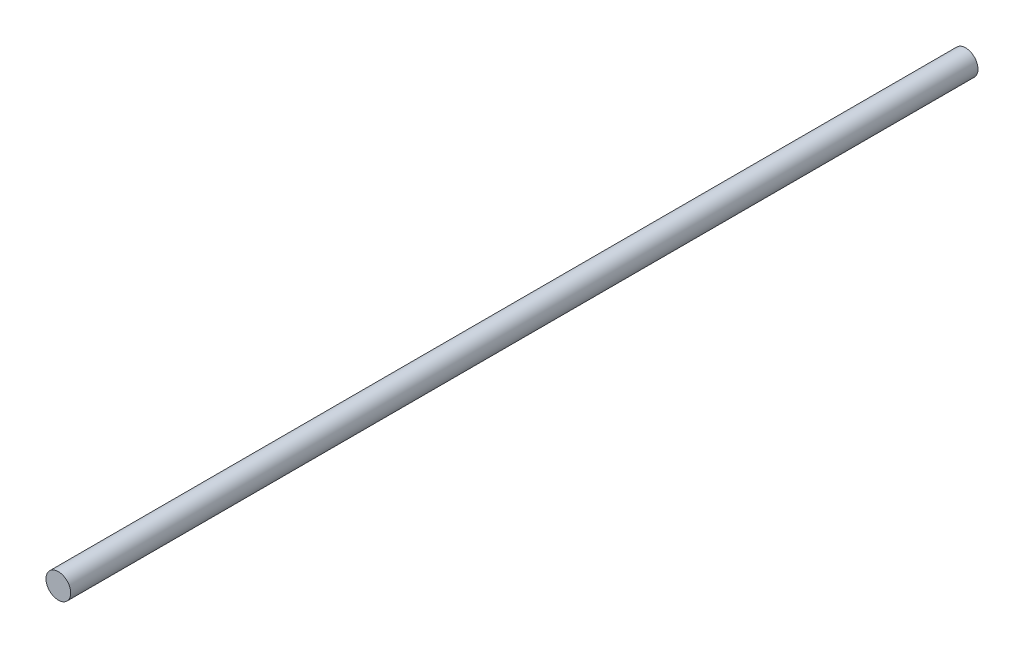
ISO-10303-21;
HEADER;
FILE_DESCRIPTION(('STEP AP214'),'2;1');
FILE_NAME('part.step','',(''),(''),'','','');
FILE_SCHEMA(('AUTOMOTIVE_DESIGN { 1 0 10303 214 1 1 1 1 }'));
ENDSEC;
DATA;
#1=APPLICATION_CONTEXT('core data for automotive mechanical design processes');
#2=APPLICATION_PROTOCOL_DEFINITION('international standard','automotive_design',2000,#1);
#3=PRODUCT_CONTEXT('',#1,'mechanical');
#4=PRODUCT('Part','Part','',(#3));
#5=PRODUCT_RELATED_PRODUCT_CATEGORY('part','',(#4));
#6=PRODUCT_DEFINITION_FORMATION('','',#4);
#7=PRODUCT_DEFINITION_CONTEXT('part definition',#1,'design');
#8=PRODUCT_DEFINITION('design','',#6,#7);
#9=PRODUCT_DEFINITION_SHAPE('','',#8);
#10=(LENGTH_UNIT() NAMED_UNIT(*) SI_UNIT(.MILLI.,.METRE.));
#11=(NAMED_UNIT(*) PLANE_ANGLE_UNIT() SI_UNIT($,.RADIAN.));
#12=(NAMED_UNIT(*) SI_UNIT($,.STERADIAN.) SOLID_ANGLE_UNIT());
#13=UNCERTAINTY_MEASURE_WITH_UNIT(LENGTH_MEASURE(1.E-05),#10,'distance_accuracy_value','');
#14=(GEOMETRIC_REPRESENTATION_CONTEXT(3) GLOBAL_UNCERTAINTY_ASSIGNED_CONTEXT((#13)) GLOBAL_UNIT_ASSIGNED_CONTEXT((#10,
#11,#12)) REPRESENTATION_CONTEXT('',''));
#15=CARTESIAN_POINT('',(0.,0.,0.));
#16=DIRECTION('',(0.,0.,1.));
#17=DIRECTION('',(1.,0.,0.));
#18=AXIS2_PLACEMENT_3D('',#15,#16,#17);
#19=CARTESIAN_POINT('',(0.,0.,-2200.));
#20=DIRECTION('',(0.,0.,1.));
#21=DIRECTION('',(1.,0.,0.));
#22=AXIS2_PLACEMENT_3D('',#19,#20,#21);
#23=CYLINDRICAL_SURFACE('',#22,30.);
#24=CARTESIAN_POINT('',(0.,0.,-2200.));
#25=DIRECTION('',(0.,0.,1.));
#26=DIRECTION('',(1.,0.,0.));
#27=AXIS2_PLACEMENT_3D('',#24,#25,#26);
#28=CIRCLE('',#27,30.);
#29=CARTESIAN_POINT('',(30.,0.,-2200.));
#30=VERTEX_POINT('',#29);
#31=EDGE_CURVE('E10',#30,#30,#28,.T.);
#32=ORIENTED_EDGE('',*,*,#31,.T.);
#33=EDGE_LOOP('',(#32));
#34=FACE_BOUND('',#33,.T.);
#35=CARTESIAN_POINT('',(0.,0.,0.));
#36=DIRECTION('',(0.,0.,1.));
#37=DIRECTION('',(1.,0.,0.));
#38=AXIS2_PLACEMENT_3D('',#35,#36,#37);
#39=CIRCLE('',#38,30.);
#40=CARTESIAN_POINT('',(30.,0.,0.));
#41=VERTEX_POINT('',#40);
#42=EDGE_CURVE('E40',#41,#41,#39,.T.);
#43=ORIENTED_EDGE('',*,*,#42,.F.);
#44=EDGE_LOOP('',(#43));
#45=FACE_BOUND('',#44,.T.);
#46=ADVANCED_FACE('F37',(#34,#45),#23,.T.);
#47=CARTESIAN_POINT('',(0.,0.,-2200.));
#48=DIRECTION('',(0.,0.,1.));
#49=DIRECTION('',(1.,0.,0.));
#50=AXIS2_PLACEMENT_3D('',#47,#48,#49);
#51=PLANE('',#50);
#52=ORIENTED_EDGE('',*,*,#31,.F.);
#53=EDGE_LOOP('',(#52));
#54=FACE_BOUND('',#53,.T.);
#55=ADVANCED_FACE('F54',(#54),#51,.F.);
#56=CARTESIAN_POINT('',(0.,0.,0.));
#57=DIRECTION('',(0.,0.,1.));
#58=DIRECTION('',(1.,0.,0.));
#59=AXIS2_PLACEMENT_3D('',#56,#57,#58);
#60=PLANE('',#59);
#61=ORIENTED_EDGE('',*,*,#42,.T.);
#62=EDGE_LOOP('',(#61));
#63=FACE_BOUND('',#62,.T.);
#64=ADVANCED_FACE('F51',(#63),#60,.T.);
#65=CLOSED_SHELL('',(#46,#55,#64));
#66=MANIFOLD_SOLID_BREP('B2',#65);
#67=ADVANCED_BREP_SHAPE_REPRESENTATION('',(#18,#66),#14);
#68=SHAPE_DEFINITION_REPRESENTATION(#9,#67);
ENDSEC;
END-ISO-10303-21;
